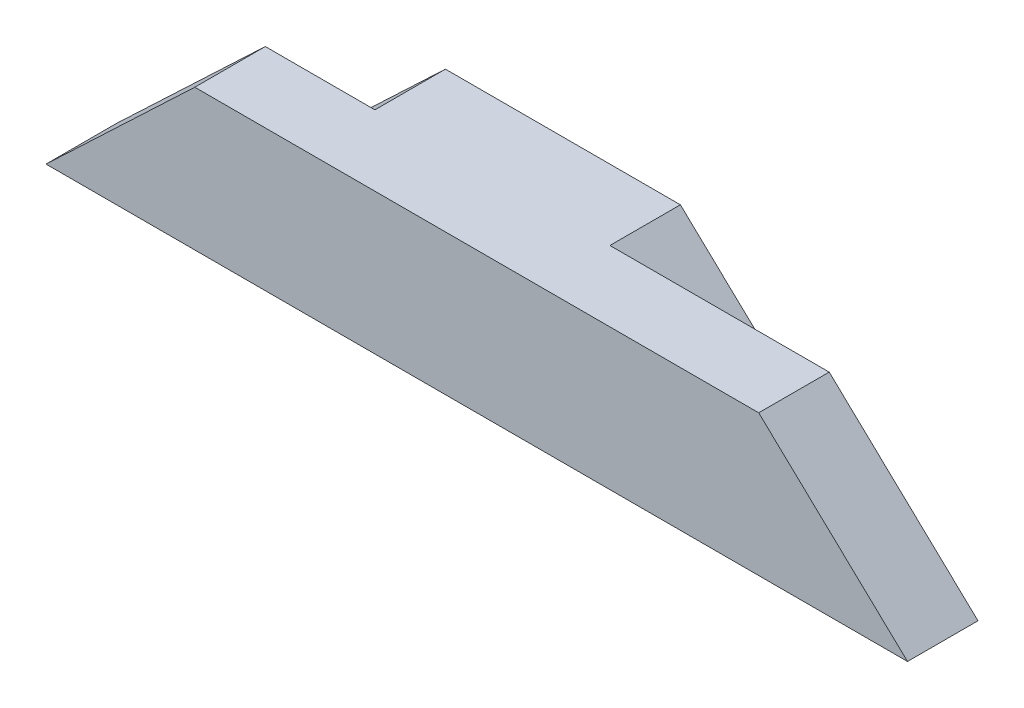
from build123d import *

# Parameters (mm, degrees)
ESQUISSE1_W                  = 62
ESQUISSE1_H                  = 9
EXTRUSION1_DEPTH             = 9
ENL_V_MAT_EXTRU_2_DEPTH      = 9
ENL_V_MAT_EXTRU_3_DEPTH      = 4.5
ENL_V_MAT_EXTRU_4_DEPTH      = 63.811225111
ENL_V_MAT_EXTRU_4_DEPTH_BACK = 63.811225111


with BuildPart() as part:
    # Esquisse1 → Extrusion1 (new body)
    with BuildSketch(Plane.XY):
        with Locations((31, 4.5)):
            Rectangle(ESQUISSE1_W, ESQUISSE1_H)
    extrude(amount=EXTRUSION1_DEPTH)

    # Esquisse2 → Enl_v. mat.-Extru.2 (cut)
    with BuildSketch(Plane.XY.offset(9)):
        Polygon((62, 9), (52.5, 9), (62, 0), align=None)
        Polygon((0, 9), (9.5, 9), (0, 0), align=None)
    extrude(amount=-ENL_V_MAT_EXTRU_2_DEPTH, mode=Mode.SUBTRACT)

    # Esquisse3 → Enl_v. mat.-Extru.3 (cut)
    with BuildSketch(Plane(origin=(0, 0, 0), x_dir=(-1, 0, 0), z_dir=(0, 0, -1))):
        Polygon((-9.5, 9), (-23.5, 9), (-14, 0), (0, 0), align=None)
        Polygon((-52.5, 9), (-38.5, 9), (-48, 0), (-62, 0), align=None)
    extrude(amount=-ENL_V_MAT_EXTRU_3_DEPTH, mode=Mode.SUBTRACT)

    # Esquisse5 → Enl_v. mat.-Extru.4 (cut, two sides: drawn at the far end of the back side and taken through both)
    with BuildSketch(Plane(origin=(0, 0, 4.5), x_dir=(-1, 0, 0), z_dir=(0, 0, -1)).offset(-ENL_V_MAT_EXTRU_4_DEPTH_BACK)):
        Polygon((125.799640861, 9), (-9.5, 9), (-16.5, 9), (-7, 0), (0, 0), (135.299640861, 0), (321.402848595, 196.44227483), (311.902848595, 205.44227483), align=None)
    extrude(amount=ENL_V_MAT_EXTRU_4_DEPTH + ENL_V_MAT_EXTRU_4_DEPTH_BACK, mode=Mode.SUBTRACT)


solid = part.part
